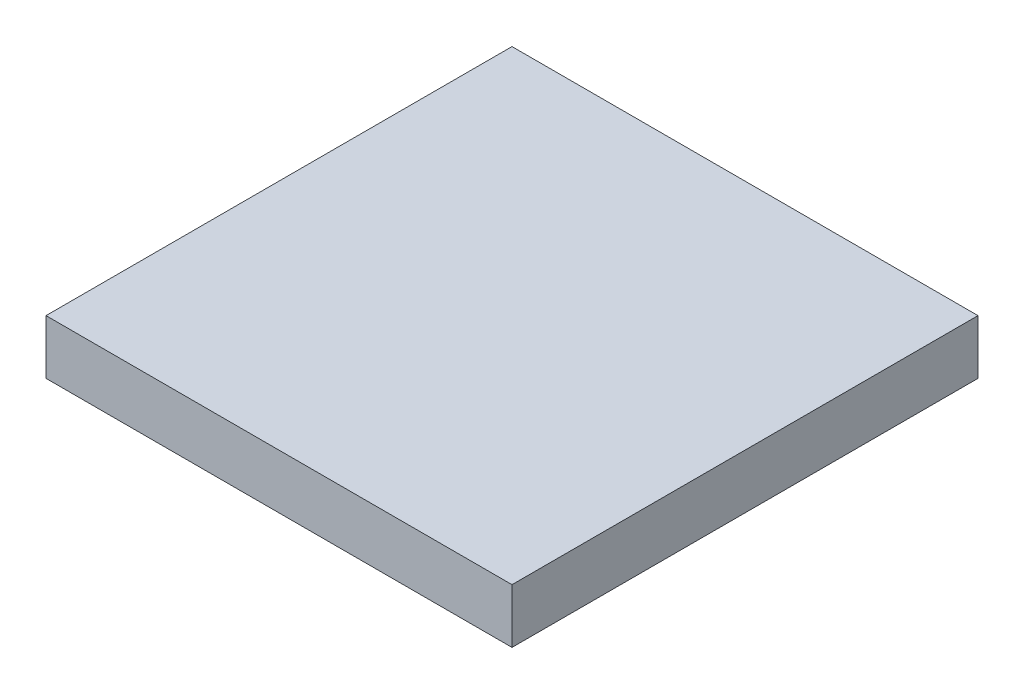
from build123d import *

# Parameters (mm, degrees)
ESQUISSE1_W      = 60
ESQUISSE1_H      = 60
EXTRUSION1_DEPTH = 7


with BuildPart() as part:
    # Esquisse1 → Extrusion1 (new body)
    with BuildSketch(Plane(origin=(0, 0, 0), x_dir=(1, 0, 0), z_dir=(0, 1, 0))):
        with Locations((30, 30)):
            Rectangle(ESQUISSE1_W, ESQUISSE1_H)
    extrude(amount=EXTRUSION1_DEPTH)


solid = part.part
